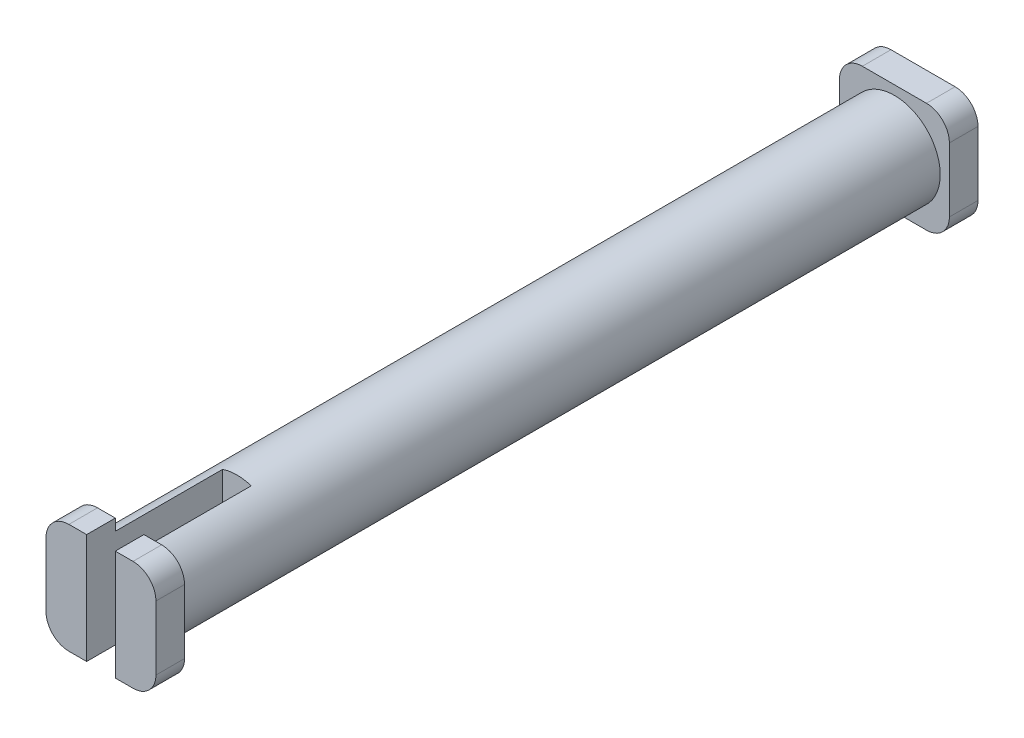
from build123d import *

# Parameters (mm, degrees)
BOSS_EXTRUDE1_DEPTH = 1.5875
SKETCH2_R           = 2.54
BOSS_EXTRUDE2_DEPTH = 42.418
SKETCH3_W           = 1.5875
SKETCH3_H           = 6.096
CUT_EXTRUDE1_DEPTH  = 7.540625


with BuildPart() as part:
    # Sketch1 → Boss-Extrude1 (new body)
    with BuildSketch(Plane.XY):
        with BuildLine():
            Line((1.27, 0), (4.826, 0))
            ThreePointArc((4.826, 0), (5.724025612, 0.371974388), (6.096, 1.27))
            Line((6.096, 1.27), (6.096, 4.826))
            ThreePointArc((6.096, 4.826), (5.724025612, 5.724025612), (4.826, 6.096))
            Line((4.826, 6.096), (1.27, 6.096))
            ThreePointArc((1.27, 6.096), (0.371974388, 5.724025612), (0, 4.826))
            Line((0, 4.826), (0, 1.27))
            ThreePointArc((0, 1.27), (0.371974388, 0.371974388), (1.27, 0))
        make_face()
    boss_extrude1 = extrude(amount=BOSS_EXTRUDE1_DEPTH)

    # Sketch2 → Boss-Extrude2 (add)
    with BuildSketch(Plane.XY.offset(1.5875)):
        with Locations((3.048, 3.048)):
            Circle(SKETCH2_R)
    extrude(amount=BOSS_EXTRUDE2_DEPTH)

    # Mirror1: Boss-Extrude1 across plane
    add(boss_extrude1.mirror(Plane.XY.offset(22.7965)))

    # Sketch3 → Cut-Extrude1 (cut)
    with BuildSketch(Plane.XY.offset(45.593)):
        with Locations((3.048, 3.048)):
            Rectangle(SKETCH3_W, SKETCH3_H)
    extrude(amount=-CUT_EXTRUDE1_DEPTH, mode=Mode.SUBTRACT)


solid = part.part
